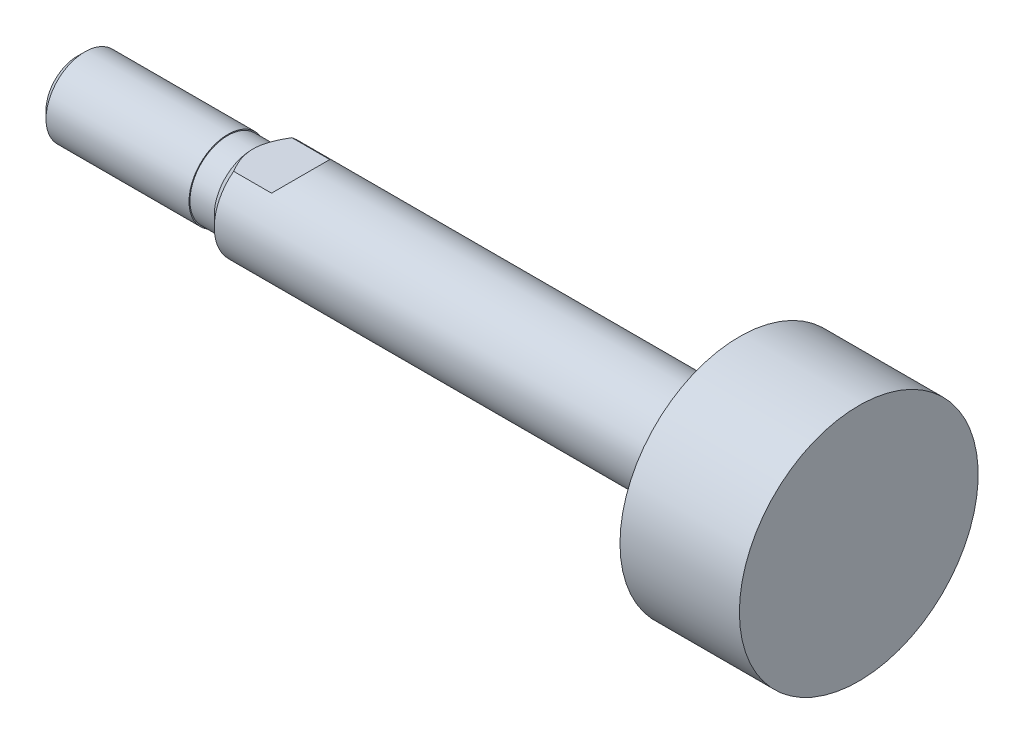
ISO-10303-21;
HEADER;
FILE_DESCRIPTION(('STEP AP214'),'2;1');
FILE_NAME('part.step','',(''),(''),'','','');
FILE_SCHEMA(('AUTOMOTIVE_DESIGN { 1 0 10303 214 1 1 1 1 }'));
ENDSEC;
DATA;
#1=APPLICATION_CONTEXT('core data for automotive mechanical design processes');
#2=APPLICATION_PROTOCOL_DEFINITION('international standard','automotive_design',2000,#1);
#3=PRODUCT_CONTEXT('',#1,'mechanical');
#4=PRODUCT('Part','Part','',(#3));
#5=PRODUCT_RELATED_PRODUCT_CATEGORY('part','',(#4));
#6=PRODUCT_DEFINITION_FORMATION('','',#4);
#7=PRODUCT_DEFINITION_CONTEXT('part definition',#1,'design');
#8=PRODUCT_DEFINITION('design','',#6,#7);
#9=PRODUCT_DEFINITION_SHAPE('','',#8);
#10=(LENGTH_UNIT() NAMED_UNIT(*) SI_UNIT(.MILLI.,.METRE.));
#11=(NAMED_UNIT(*) PLANE_ANGLE_UNIT() SI_UNIT($,.RADIAN.));
#12=(NAMED_UNIT(*) SI_UNIT($,.STERADIAN.) SOLID_ANGLE_UNIT());
#13=UNCERTAINTY_MEASURE_WITH_UNIT(LENGTH_MEASURE(1.E-05),#10,'distance_accuracy_value','');
#14=(GEOMETRIC_REPRESENTATION_CONTEXT(3) GLOBAL_UNCERTAINTY_ASSIGNED_CONTEXT((#13)) GLOBAL_UNIT_ASSIGNED_CONTEXT((#10,
#11,#12)) REPRESENTATION_CONTEXT('',''));
#15=CARTESIAN_POINT('',(0.,0.,0.));
#16=DIRECTION('',(0.,0.,1.));
#17=DIRECTION('',(1.,0.,0.));
#18=AXIS2_PLACEMENT_3D('',#15,#16,#17);
#19=CARTESIAN_POINT('',(-23.,0.,0.));
#20=DIRECTION('',(1.,0.,0.));
#21=DIRECTION('',(0.,0.,-1.));
#22=AXIS2_PLACEMENT_3D('',#19,#20,#21);
#23=PLANE('',#22);
#24=CARTESIAN_POINT('',(-23.,0.,0.));
#25=DIRECTION('',(-1.,0.,0.));
#26=DIRECTION('',(0.,0.,1.));
#27=AXIS2_PLACEMENT_3D('',#24,#25,#26);
#28=CIRCLE('',#27,3.233);
#29=CARTESIAN_POINT('',(-23.,0.,3.233));
#30=VERTEX_POINT('',#29);
#31=EDGE_CURVE('E61',#30,#30,#28,.T.);
#32=ORIENTED_EDGE('',*,*,#31,.T.);
#33=EDGE_LOOP('',(#32));
#34=FACE_BOUND('',#33,.T.);
#35=ADVANCED_FACE('F16',(#34),#23,.F.);
#36=CARTESIAN_POINT('',(-22.233,0.,0.));
#37=DIRECTION('',(1.,0.,0.));
#38=DIRECTION('',(0.,0.,-1.));
#39=AXIS2_PLACEMENT_3D('',#36,#37,#38);
#40=CONICAL_SURFACE('',#39,4.,0.785398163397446);
#41=ORIENTED_EDGE('',*,*,#31,.F.);
#42=EDGE_LOOP('',(#41));
#43=FACE_BOUND('',#42,.T.);
#44=CARTESIAN_POINT('',(-22.233,0.,0.));
#45=DIRECTION('',(-1.,0.,0.));
#46=DIRECTION('',(0.,0.,1.));
#47=AXIS2_PLACEMENT_3D('',#44,#45,#46);
#48=CIRCLE('',#47,4.);
#49=CARTESIAN_POINT('',(-22.233,0.,4.));
#50=VERTEX_POINT('',#49);
#51=EDGE_CURVE('E141',#50,#50,#48,.T.);
#52=ORIENTED_EDGE('',*,*,#51,.T.);
#53=EDGE_LOOP('',(#52));
#54=FACE_BOUND('',#53,.T.);
#55=ADVANCED_FACE('F131',(#43,#54),#40,.T.);
#56=CARTESIAN_POINT('',(57.5,0.,0.));
#57=DIRECTION('',(-1.,0.,0.));
#58=DIRECTION('',(0.,0.,1.));
#59=AXIS2_PLACEMENT_3D('',#56,#57,#58);
#60=CYLINDRICAL_SURFACE('',#59,4.);
#61=ORIENTED_EDGE('',*,*,#51,.F.);
#62=EDGE_LOOP('',(#61));
#63=FACE_BOUND('',#62,.T.);
#64=CARTESIAN_POINT('',(-7.5,0.,0.));
#65=DIRECTION('',(-1.,0.,0.));
#66=DIRECTION('',(0.,0.,1.));
#67=AXIS2_PLACEMENT_3D('',#64,#65,#66);
#68=CIRCLE('',#67,4.);
#69=CARTESIAN_POINT('',(-7.5,0.,4.));
#70=VERTEX_POINT('',#69);
#71=EDGE_CURVE('E144',#70,#70,#68,.T.);
#72=ORIENTED_EDGE('',*,*,#71,.T.);
#73=EDGE_LOOP('',(#72));
#74=FACE_BOUND('',#73,.T.);
#75=ADVANCED_FACE('F137',(#63,#74),#60,.T.);
#76=CARTESIAN_POINT('',(-7.5,4.,0.));
#77=DIRECTION('',(-1.,0.,0.));
#78=DIRECTION('',(0.,0.,1.));
#79=AXIS2_PLACEMENT_3D('',#76,#77,#78);
#80=PLANE('',#79);
#81=ORIENTED_EDGE('',*,*,#71,.F.);
#82=EDGE_LOOP('',(#81));
#83=FACE_BOUND('',#82,.T.);
#84=CARTESIAN_POINT('',(-7.5,0.,0.));
#85=DIRECTION('',(-1.,0.,0.));
#86=DIRECTION('',(0.,0.,1.));
#87=AXIS2_PLACEMENT_3D('',#84,#85,#86);
#88=CIRCLE('',#87,3.9);
#89=CARTESIAN_POINT('',(-7.5,0.,3.9));
#90=VERTEX_POINT('',#89);
#91=EDGE_CURVE('E149',#90,#90,#88,.T.);
#92=ORIENTED_EDGE('',*,*,#91,.T.);
#93=EDGE_LOOP('',(#92));
#94=FACE_BOUND('',#93,.T.);
#95=ADVANCED_FACE('F174',(#83,#94),#80,.F.);
#96=CARTESIAN_POINT('',(57.5,0.,0.));
#97=DIRECTION('',(-1.,0.,0.));
#98=DIRECTION('',(0.,0.,1.));
#99=AXIS2_PLACEMENT_3D('',#96,#97,#98);
#100=CYLINDRICAL_SURFACE('',#99,3.9);
#101=ORIENTED_EDGE('',*,*,#91,.F.);
#102=EDGE_LOOP('',(#101));
#103=FACE_BOUND('',#102,.T.);
#104=CARTESIAN_POINT('',(-5.,0.,0.));
#105=DIRECTION('',(-1.,0.,0.));
#106=DIRECTION('',(0.,0.,1.));
#107=AXIS2_PLACEMENT_3D('',#104,#105,#106);
#108=CIRCLE('',#107,3.9);
#109=CARTESIAN_POINT('',(-5.,0.,3.9));
#110=VERTEX_POINT('',#109);
#111=EDGE_CURVE('E152',#110,#110,#108,.T.);
#112=ORIENTED_EDGE('',*,*,#111,.T.);
#113=EDGE_LOOP('',(#112));
#114=FACE_BOUND('',#113,.T.);
#115=ADVANCED_FACE('F128',(#103,#114),#100,.T.);
#116=CARTESIAN_POINT('',(-3.9,0.,0.));
#117=DIRECTION('',(1.,0.,0.));
#118=DIRECTION('',(0.,0.,-1.));
#119=AXIS2_PLACEMENT_3D('',#116,#117,#118);
#120=CONICAL_SURFACE('',#119,5.,0.785398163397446);
#121=ORIENTED_EDGE('',*,*,#111,.F.);
#122=EDGE_LOOP('',(#121));
#123=FACE_BOUND('',#122,.T.);
#124=CARTESIAN_POINT('',(-3.9,0.,0.));
#125=DIRECTION('',(-1.,0.,0.));
#126=DIRECTION('',(0.,0.,1.));
#127=AXIS2_PLACEMENT_3D('',#124,#125,#126);
#128=CIRCLE('',#127,5.);
#129=CARTESIAN_POINT('',(-3.9,-4.,3.));
#130=VERTEX_POINT('',#129);
#131=CARTESIAN_POINT('',(-3.9,4.,3.));
#132=VERTEX_POINT('',#131);
#133=EDGE_CURVE('E72',#130,#132,#128,.T.);
#134=ORIENTED_EDGE('',*,*,#133,.T.);
#135=CARTESIAN_POINT('',(0.0592148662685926,4.,-8.01670325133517));
#136=CARTESIAN_POINT('',(-0.104734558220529,4.,-7.83345168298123));
#137=CARTESIAN_POINT('',(-0.268089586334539,4.,-7.64966351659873));
#138=CARTESIAN_POINT('',(-0.593295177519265,4.,-7.28073119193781));
#139=CARTESIAN_POINT('',(-0.755145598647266,4.,-7.09558690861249));
#140=CARTESIAN_POINT('',(-1.0776076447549,4.,-6.72298642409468));
#141=CARTESIAN_POINT('',(-1.23821221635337,4.,-6.53552410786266));
#142=CARTESIAN_POINT('',(-1.55707481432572,4.,-6.15862459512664));
#143=CARTESIAN_POINT('',(-1.71533293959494,4.,-5.96918748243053));
#144=CARTESIAN_POINT('',(-2.03813105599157,4.,-5.57660035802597));
#145=CARTESIAN_POINT('',(-2.20249013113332,4.,-5.37330116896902));
#146=CARTESIAN_POINT('',(-2.52679503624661,4.,-4.96321595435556));
#147=CARTESIAN_POINT('',(-2.68674111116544,4.,-4.75643012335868));
#148=CARTESIAN_POINT('',(-3.00041962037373,4.,-4.33867158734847));
#149=CARTESIAN_POINT('',(-3.15416117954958,4.,-4.12770576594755));
#150=CARTESIAN_POINT('',(-3.45331338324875,4.,-3.69997752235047));
#151=CARTESIAN_POINT('',(-3.59872661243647,4.,-3.48321692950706));
#152=CARTESIAN_POINT('',(-3.83936139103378,4.,-3.10248405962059));
#153=CARTESIAN_POINT('',(-3.93742116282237,4.,-2.94031515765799));
#154=CARTESIAN_POINT('',(-4.12514033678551,4.,-2.61105481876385));
#155=CARTESIAN_POINT('',(-4.21479674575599,4.,-2.44396165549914));
#156=CARTESIAN_POINT('',(-4.38202517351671,4.,-2.10559748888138));
#157=CARTESIAN_POINT('',(-4.45969673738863,4.,-1.93437628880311));
#158=CARTESIAN_POINT('',(-4.60004030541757,4.,-1.58587891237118));
#159=CARTESIAN_POINT('',(-4.66272371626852,4.,-1.40860745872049));
#160=CARTESIAN_POINT('',(-4.74994261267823,4.,-1.11151605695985));
#161=CARTESIAN_POINT('',(-4.78014609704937,4.,-0.99336222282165));
#162=CARTESIAN_POINT('',(-4.83103250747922,4.,-0.755007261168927));
#163=CARTESIAN_POINT('',(-4.85171703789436,4.,-0.634806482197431));
#164=CARTESIAN_POINT('',(-4.88246398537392,4.,-0.393510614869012));
#165=CARTESIAN_POINT('',(-4.89256745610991,4.,-0.272420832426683));
#166=CARTESIAN_POINT('',(-4.901725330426,4.,-0.0298174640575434));
#167=CARTESIAN_POINT('',(-4.9007798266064,4.,0.0916961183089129));
#168=CARTESIAN_POINT('',(-4.88792304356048,4.,0.33360603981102));
#169=CARTESIAN_POINT('',(-4.87605905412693,4.,0.454004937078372));
#170=CARTESIAN_POINT('',(-4.84208274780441,4.,0.693353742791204));
#171=CARTESIAN_POINT('',(-4.81996803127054,4.,0.812303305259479));
#172=CARTESIAN_POINT('',(-4.76625038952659,4.,1.04947269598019));
#173=CARTESIAN_POINT('',(-4.73453978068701,4.,1.16766782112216));
#174=CARTESIAN_POINT('',(-4.66303307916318,4.,1.40153085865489));
#175=CARTESIAN_POINT('',(-4.62323841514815,4.,1.51719921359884));
#176=CARTESIAN_POINT('',(-4.52401503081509,4.,1.77992372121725));
#177=CARTESIAN_POINT('',(-4.46226527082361,4.,1.92609880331));
#178=CARTESIAN_POINT('',(-4.32977716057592,4.,2.21434798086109));
#179=CARTESIAN_POINT('',(-4.25903403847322,4.,2.35641984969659));
#180=CARTESIAN_POINT('',(-4.11029151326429,4.,2.63733832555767));
#181=CARTESIAN_POINT('',(-4.03226690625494,4.,2.77617148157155));
#182=CARTESIAN_POINT('',(-3.87072949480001,4.,3.05054974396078));
#183=CARTESIAN_POINT('',(-3.78721771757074,4.,3.18609545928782));
#184=CARTESIAN_POINT('',(-3.62008100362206,4.,3.44777720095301));
#185=CARTESIAN_POINT('',(-3.53666511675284,4.,3.57404744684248));
#186=CARTESIAN_POINT('',(-3.36665654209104,4.,3.82443880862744));
#187=CARTESIAN_POINT('',(-3.28006360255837,4.,3.94855975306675));
#188=CARTESIAN_POINT('',(-3.1050645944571,4.,4.19387836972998));
#189=CARTESIAN_POINT('',(-3.01668096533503,4.,4.31509210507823));
#190=CARTESIAN_POINT('',(-2.83782414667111,4.,4.55591957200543));
#191=CARTESIAN_POINT('',(-2.74735152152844,4.,4.67553372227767));
#192=CARTESIAN_POINT('',(-2.65603372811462,4.,4.79448796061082));
#193=B_SPLINE_CURVE_WITH_KNOTS('',3,(#135,#136,#137,#138,#139,#140,#141,#142,#143,#144,#145,
#146,#147,#148,#149,#150,#151,#152,#153,#154,#155,#156,#157,#158,#159,#160,#161,#162,#163,#164,
#165,#166,#167,#168,#169,#170,#171,#172,#173,#174,#175,#176,#177,#178,#179,#180,#181,#182,#183,
#184,#185,#186,#187,#188,#189,#190,#191,#192),.UNSPECIFIED.,.F.,.F.,(4,2,2,2,2,2,2,2,2,2,2,2,2,
2,2,2,2,2,2,2,2,2,2,2,2,2,2,2,4),(0.,0.737665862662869,1.47540062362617,2.2159414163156,
2.95645090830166,3.74068924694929,4.52488396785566,5.3078799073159,6.09063151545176,
6.65898208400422,7.22753433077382,7.79107544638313,8.35418630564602,8.71971611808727,
9.08518430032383,9.44922918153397,9.8132710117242,10.1757434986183,10.5383008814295,
10.9050880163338,11.2718103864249,11.7474518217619,12.2233466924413,12.7009546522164,
13.1784734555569,13.6324221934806,14.0864069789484,14.5364269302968,14.9863266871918),.UNSPECIFIED.);
#194=CARTESIAN_POINT('',(-3.9,4.,-3.));
#195=VERTEX_POINT('',#194);
#196=EDGE_CURVE('E82',#132,#195,#193,.F.);
#197=ORIENTED_EDGE('',*,*,#196,.T.);
#198=CARTESIAN_POINT('',(-3.9,-4.,-3.));
#199=VERTEX_POINT('',#198);
#200=EDGE_CURVE('E155',#195,#199,#128,.T.);
#201=ORIENTED_EDGE('',*,*,#200,.T.);
#202=CARTESIAN_POINT('',(0.0592148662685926,-4.,-8.01670325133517));
#203=CARTESIAN_POINT('',(-0.104734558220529,-4.,-7.83345168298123));
#204=CARTESIAN_POINT('',(-0.268089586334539,-4.,-7.64966351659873));
#205=CARTESIAN_POINT('',(-0.593295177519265,-4.,-7.28073119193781));
#206=CARTESIAN_POINT('',(-0.755145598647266,-4.,-7.09558690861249));
#207=CARTESIAN_POINT('',(-1.0776076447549,-4.,-6.72298642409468));
#208=CARTESIAN_POINT('',(-1.23821221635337,-4.,-6.53552410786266));
#209=CARTESIAN_POINT('',(-1.55707481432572,-4.,-6.15862459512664));
#210=CARTESIAN_POINT('',(-1.71533293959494,-4.,-5.96918748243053));
#211=CARTESIAN_POINT('',(-2.03813105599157,-4.,-5.57660035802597));
#212=CARTESIAN_POINT('',(-2.20249013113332,-4.,-5.37330116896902));
#213=CARTESIAN_POINT('',(-2.52679503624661,-4.,-4.96321595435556));
#214=CARTESIAN_POINT('',(-2.68674111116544,-4.,-4.75643012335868));
#215=CARTESIAN_POINT('',(-3.00041962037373,-4.,-4.33867158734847));
#216=CARTESIAN_POINT('',(-3.15416117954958,-4.,-4.12770576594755));
#217=CARTESIAN_POINT('',(-3.45331338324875,-4.,-3.69997752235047));
#218=CARTESIAN_POINT('',(-3.59872661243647,-4.,-3.48321692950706));
#219=CARTESIAN_POINT('',(-3.83936139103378,-4.,-3.10248405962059));
#220=CARTESIAN_POINT('',(-3.93742116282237,-4.,-2.94031515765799));
#221=CARTESIAN_POINT('',(-4.12514033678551,-4.,-2.61105481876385));
#222=CARTESIAN_POINT('',(-4.21479674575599,-4.,-2.44396165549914));
#223=CARTESIAN_POINT('',(-4.38202517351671,-4.,-2.10559748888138));
#224=CARTESIAN_POINT('',(-4.45969673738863,-4.,-1.93437628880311));
#225=CARTESIAN_POINT('',(-4.60004030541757,-4.,-1.58587891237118));
#226=CARTESIAN_POINT('',(-4.66272371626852,-4.,-1.40860745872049));
#227=CARTESIAN_POINT('',(-4.74994261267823,-4.,-1.11151605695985));
#228=CARTESIAN_POINT('',(-4.78014609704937,-4.,-0.99336222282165));
#229=CARTESIAN_POINT('',(-4.83103250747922,-4.,-0.755007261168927));
#230=CARTESIAN_POINT('',(-4.85171703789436,-4.,-0.634806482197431));
#231=CARTESIAN_POINT('',(-4.88246398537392,-4.,-0.393510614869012));
#232=CARTESIAN_POINT('',(-4.89256745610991,-4.,-0.272420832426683));
#233=CARTESIAN_POINT('',(-4.901725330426,-4.,-0.0298174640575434));
#234=CARTESIAN_POINT('',(-4.9007798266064,-4.,0.0916961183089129));
#235=CARTESIAN_POINT('',(-4.88792304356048,-4.,0.33360603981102));
#236=CARTESIAN_POINT('',(-4.87605905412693,-4.,0.454004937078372));
#237=CARTESIAN_POINT('',(-4.84208274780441,-4.,0.693353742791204));
#238=CARTESIAN_POINT('',(-4.81996803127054,-4.,0.812303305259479));
#239=CARTESIAN_POINT('',(-4.76625038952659,-4.,1.04947269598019));
#240=CARTESIAN_POINT('',(-4.73453978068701,-4.,1.16766782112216));
#241=CARTESIAN_POINT('',(-4.66303307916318,-4.,1.40153085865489));
#242=CARTESIAN_POINT('',(-4.62323841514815,-4.,1.51719921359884));
#243=CARTESIAN_POINT('',(-4.52401503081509,-4.,1.77992372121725));
#244=CARTESIAN_POINT('',(-4.46226527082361,-4.,1.92609880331));
#245=CARTESIAN_POINT('',(-4.32977716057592,-4.,2.21434798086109));
#246=CARTESIAN_POINT('',(-4.25903403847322,-4.,2.35641984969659));
#247=CARTESIAN_POINT('',(-4.11029151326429,-4.,2.63733832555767));
#248=CARTESIAN_POINT('',(-4.03226690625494,-4.,2.77617148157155));
#249=CARTESIAN_POINT('',(-3.87072949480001,-4.,3.05054974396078));
#250=CARTESIAN_POINT('',(-3.78721771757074,-4.,3.18609545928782));
#251=CARTESIAN_POINT('',(-3.62008100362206,-4.,3.44777720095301));
#252=CARTESIAN_POINT('',(-3.53666511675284,-4.,3.57404744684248));
#253=CARTESIAN_POINT('',(-3.36665654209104,-4.,3.82443880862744));
#254=CARTESIAN_POINT('',(-3.28006360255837,-4.,3.94855975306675));
#255=CARTESIAN_POINT('',(-3.1050645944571,-4.,4.19387836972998));
#256=CARTESIAN_POINT('',(-3.01668096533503,-4.,4.31509210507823));
#257=CARTESIAN_POINT('',(-2.83782414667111,-4.,4.55591957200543));
#258=CARTESIAN_POINT('',(-2.74735152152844,-4.,4.67553372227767));
#259=CARTESIAN_POINT('',(-2.65603372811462,-4.,4.79448796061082));
#260=B_SPLINE_CURVE_WITH_KNOTS('',3,(#202,#203,#204,#205,#206,#207,#208,#209,#210,#211,#212,
#213,#214,#215,#216,#217,#218,#219,#220,#221,#222,#223,#224,#225,#226,#227,#228,#229,#230,#231,
#232,#233,#234,#235,#236,#237,#238,#239,#240,#241,#242,#243,#244,#245,#246,#247,#248,#249,#250,
#251,#252,#253,#254,#255,#256,#257,#258,#259),.UNSPECIFIED.,.F.,.F.,(4,2,2,2,2,2,2,2,2,2,2,2,2,
2,2,2,2,2,2,2,2,2,2,2,2,2,2,2,4),(0.,0.737665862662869,1.47540062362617,2.2159414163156,
2.95645090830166,3.74068924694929,4.52488396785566,5.3078799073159,6.09063151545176,
6.65898208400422,7.22753433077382,7.79107544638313,8.35418630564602,8.71971611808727,
9.08518430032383,9.44922918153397,9.8132710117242,10.1757434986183,10.5383008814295,
10.9050880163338,11.2718103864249,11.7474518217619,12.2233466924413,12.7009546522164,
13.1784734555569,13.6324221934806,14.0864069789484,14.5364269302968,14.9863266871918),.UNSPECIFIED.);
#261=EDGE_CURVE('E84',#199,#130,#260,.T.);
#262=ORIENTED_EDGE('',*,*,#261,.T.);
#263=EDGE_LOOP('',(#134,#197,#201,#262));
#264=FACE_BOUND('',#263,.T.);
#265=ADVANCED_FACE('F100',(#123,#264),#120,.T.);
#266=CARTESIAN_POINT('',(57.5,0.,0.));
#267=DIRECTION('',(-1.,0.,0.));
#268=DIRECTION('',(0.,0.,1.));
#269=AXIS2_PLACEMENT_3D('',#266,#267,#268);
#270=CYLINDRICAL_SURFACE('',#269,5.);
#271=CARTESIAN_POINT('',(-4.,0.,0.));
#272=DIRECTION('',(0.707106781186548,-0.707106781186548,0.));
#273=DIRECTION('',(-0.707106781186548,-0.707106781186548,0.));
#274=AXIS2_PLACEMENT_3D('',#271,#272,#273);
#275=ELLIPSE('',#274,7.07106781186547,5.);
#276=CARTESIAN_POINT('',(0.,4.,-3.));
#277=VERTEX_POINT('',#276);
#278=CARTESIAN_POINT('',(0.,4.,3.));
#279=VERTEX_POINT('',#278);
#280=EDGE_CURVE('E23',#277,#279,#275,.T.);
#281=ORIENTED_EDGE('',*,*,#280,.T.);
#282=DIRECTION('',(-1.,0.,0.));
#283=VECTOR('',#282,1.);
#284=CARTESIAN_POINT('',(57.5,4.,3.));
#285=LINE('',#284,#283);
#286=EDGE_CURVE('E11',#279,#132,#285,.T.);
#287=ORIENTED_EDGE('',*,*,#286,.T.);
#288=ORIENTED_EDGE('',*,*,#133,.F.);
#289=DIRECTION('',(-1.,0.,0.));
#290=VECTOR('',#289,1.);
#291=CARTESIAN_POINT('',(57.5,-4.,3.));
#292=LINE('',#291,#290);
#293=CARTESIAN_POINT('',(0.,-4.,3.));
#294=VERTEX_POINT('',#293);
#295=EDGE_CURVE('E65',#130,#294,#292,.F.);
#296=ORIENTED_EDGE('',*,*,#295,.T.);
#297=CARTESIAN_POINT('',(-4.,0.,0.));
#298=DIRECTION('',(0.707106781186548,0.707106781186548,0.));
#299=DIRECTION('',(-0.707106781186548,0.707106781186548,0.));
#300=AXIS2_PLACEMENT_3D('',#297,#298,#299);
#301=ELLIPSE('',#300,7.07106781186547,5.);
#302=CARTESIAN_POINT('',(0.,-4.,-3.));
#303=VERTEX_POINT('',#302);
#304=EDGE_CURVE('E55',#294,#303,#301,.T.);
#305=ORIENTED_EDGE('',*,*,#304,.T.);
#306=DIRECTION('',(-1.,0.,0.));
#307=VECTOR('',#306,1.);
#308=CARTESIAN_POINT('',(57.5,-4.,-3.));
#309=LINE('',#308,#307);
#310=EDGE_CURVE('E60',#303,#199,#309,.T.);
#311=ORIENTED_EDGE('',*,*,#310,.T.);
#312=ORIENTED_EDGE('',*,*,#200,.F.);
#313=DIRECTION('',(-1.,0.,0.));
#314=VECTOR('',#313,1.);
#315=CARTESIAN_POINT('',(57.5,4.,-3.));
#316=LINE('',#315,#314);
#317=EDGE_CURVE('E73',#195,#277,#316,.F.);
#318=ORIENTED_EDGE('',*,*,#317,.T.);
#319=EDGE_LOOP('',(#281,#287,#288,#296,#305,#311,#312,#318));
#320=FACE_BOUND('',#319,.T.);
#321=CARTESIAN_POINT('',(45.2,0.,0.));
#322=DIRECTION('',(-1.,0.,0.));
#323=DIRECTION('',(0.,0.,1.));
#324=AXIS2_PLACEMENT_3D('',#321,#322,#323);
#325=CIRCLE('',#324,5.);
#326=CARTESIAN_POINT('',(45.2,0.,5.));
#327=VERTEX_POINT('',#326);
#328=EDGE_CURVE('E157',#327,#327,#325,.T.);
#329=ORIENTED_EDGE('',*,*,#328,.T.);
#330=EDGE_LOOP('',(#329));
#331=FACE_BOUND('',#330,.T.);
#332=ADVANCED_FACE('F69',(#320,#331),#270,.T.);
#333=CARTESIAN_POINT('',(45.2,5.,0.));
#334=DIRECTION('',(1.,0.,0.));
#335=DIRECTION('',(0.,0.,-1.));
#336=AXIS2_PLACEMENT_3D('',#333,#334,#335);
#337=PLANE('',#336);
#338=ORIENTED_EDGE('',*,*,#328,.F.);
#339=EDGE_LOOP('',(#338));
#340=FACE_BOUND('',#339,.T.);
#341=CARTESIAN_POINT('',(45.2,0.,0.));
#342=DIRECTION('',(-1.,0.,0.));
#343=DIRECTION('',(0.,0.,1.));
#344=AXIS2_PLACEMENT_3D('',#341,#342,#343);
#345=CIRCLE('',#344,12.3);
#346=CARTESIAN_POINT('',(45.2,0.,12.3));
#347=VERTEX_POINT('',#346);
#348=EDGE_CURVE('E160',#347,#347,#345,.T.);
#349=ORIENTED_EDGE('',*,*,#348,.T.);
#350=EDGE_LOOP('',(#349));
#351=FACE_BOUND('',#350,.T.);
#352=ADVANCED_FACE('F118',(#340,#351),#337,.F.);
#353=CARTESIAN_POINT('',(57.5,0.,0.));
#354=DIRECTION('',(-1.,0.,0.));
#355=DIRECTION('',(0.,0.,1.));
#356=AXIS2_PLACEMENT_3D('',#353,#354,#355);
#357=CYLINDRICAL_SURFACE('',#356,12.3);
#358=ORIENTED_EDGE('',*,*,#348,.F.);
#359=EDGE_LOOP('',(#358));
#360=FACE_BOUND('',#359,.T.);
#361=CARTESIAN_POINT('',(57.5,0.,0.));
#362=DIRECTION('',(-1.,0.,0.));
#363=DIRECTION('',(0.,0.,1.));
#364=AXIS2_PLACEMENT_3D('',#361,#362,#363);
#365=CIRCLE('',#364,12.3);
#366=CARTESIAN_POINT('',(57.5,0.,12.3));
#367=VERTEX_POINT('',#366);
#368=EDGE_CURVE('E162',#367,#367,#365,.T.);
#369=ORIENTED_EDGE('',*,*,#368,.T.);
#370=EDGE_LOOP('',(#369));
#371=FACE_BOUND('',#370,.T.);
#372=ADVANCED_FACE('F114',(#360,#371),#357,.T.);
#373=CARTESIAN_POINT('',(57.5,12.3,0.));
#374=DIRECTION('',(-1.,0.,0.));
#375=DIRECTION('',(0.,0.,1.));
#376=AXIS2_PLACEMENT_3D('',#373,#374,#375);
#377=PLANE('',#376);
#378=ORIENTED_EDGE('',*,*,#368,.F.);
#379=EDGE_LOOP('',(#378));
#380=FACE_BOUND('',#379,.T.);
#381=ADVANCED_FACE('F111',(#380),#377,.F.);
#382=CARTESIAN_POINT('',(1.,-5.,-10.));
#383=DIRECTION('',(0.707106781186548,0.707106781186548,0.));
#384=DIRECTION('',(-0.707106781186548,0.707106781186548,0.));
#385=AXIS2_PLACEMENT_3D('',#382,#383,#384);
#386=PLANE('',#385);
#387=DIRECTION('',(0.,0.,1.));
#388=VECTOR('',#387,1.);
#389=CARTESIAN_POINT('',(0.,-4.,-10.));
#390=LINE('',#389,#388);
#391=EDGE_CURVE('E37',#303,#294,#390,.T.);
#392=ORIENTED_EDGE('',*,*,#391,.F.);
#393=ORIENTED_EDGE('',*,*,#304,.F.);
#394=EDGE_LOOP('',(#392,#393));
#395=FACE_BOUND('',#394,.T.);
#396=ADVANCED_FACE('F56',(#395),#386,.F.);
#397=CARTESIAN_POINT('',(0.,-4.,-10.));
#398=DIRECTION('',(0.,1.,0.));
#399=DIRECTION('',(0.,0.,1.));
#400=AXIS2_PLACEMENT_3D('',#397,#398,#399);
#401=PLANE('',#400);
#402=ORIENTED_EDGE('',*,*,#391,.T.);
#403=ORIENTED_EDGE('',*,*,#295,.F.);
#404=ORIENTED_EDGE('',*,*,#261,.F.);
#405=ORIENTED_EDGE('',*,*,#310,.F.);
#406=EDGE_LOOP('',(#402,#403,#404,#405));
#407=FACE_BOUND('',#406,.T.);
#408=ADVANCED_FACE('F64',(#407),#401,.F.);
#409=CARTESIAN_POINT('',(0.,4.,-10.));
#410=DIRECTION('',(0.707106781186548,-0.707106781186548,0.));
#411=DIRECTION('',(0.707106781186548,0.707106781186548,0.));
#412=AXIS2_PLACEMENT_3D('',#409,#410,#411);
#413=PLANE('',#412);
#414=DIRECTION('',(0.,0.,1.));
#415=VECTOR('',#414,1.);
#416=CARTESIAN_POINT('',(0.,4.,-10.));
#417=LINE('',#416,#415);
#418=EDGE_CURVE('E30',#277,#279,#417,.T.);
#419=ORIENTED_EDGE('',*,*,#418,.T.);
#420=ORIENTED_EDGE('',*,*,#280,.F.);
#421=EDGE_LOOP('',(#419,#420));
#422=FACE_BOUND('',#421,.T.);
#423=ADVANCED_FACE('F83',(#422),#413,.F.);
#424=CARTESIAN_POINT('',(-27.,4.,-10.));
#425=DIRECTION('',(0.,-1.,0.));
#426=DIRECTION('',(0.,0.,-1.));
#427=AXIS2_PLACEMENT_3D('',#424,#425,#426);
#428=PLANE('',#427);
#429=ORIENTED_EDGE('',*,*,#418,.F.);
#430=ORIENTED_EDGE('',*,*,#317,.F.);
#431=ORIENTED_EDGE('',*,*,#196,.F.);
#432=ORIENTED_EDGE('',*,*,#286,.F.);
#433=EDGE_LOOP('',(#429,#430,#431,#432));
#434=FACE_BOUND('',#433,.T.);
#435=ADVANCED_FACE('F80',(#434),#428,.F.);
#436=CLOSED_SHELL('',(#35,#55,#75,#95,#115,#265,#332,#352,#372,#381,#396,#408,#423,#435));
#437=MANIFOLD_SOLID_BREP('B1',#436);
#438=ADVANCED_BREP_SHAPE_REPRESENTATION('',(#18,#437),#14);
#439=SHAPE_DEFINITION_REPRESENTATION(#9,#438);
ENDSEC;
END-ISO-10303-21;
